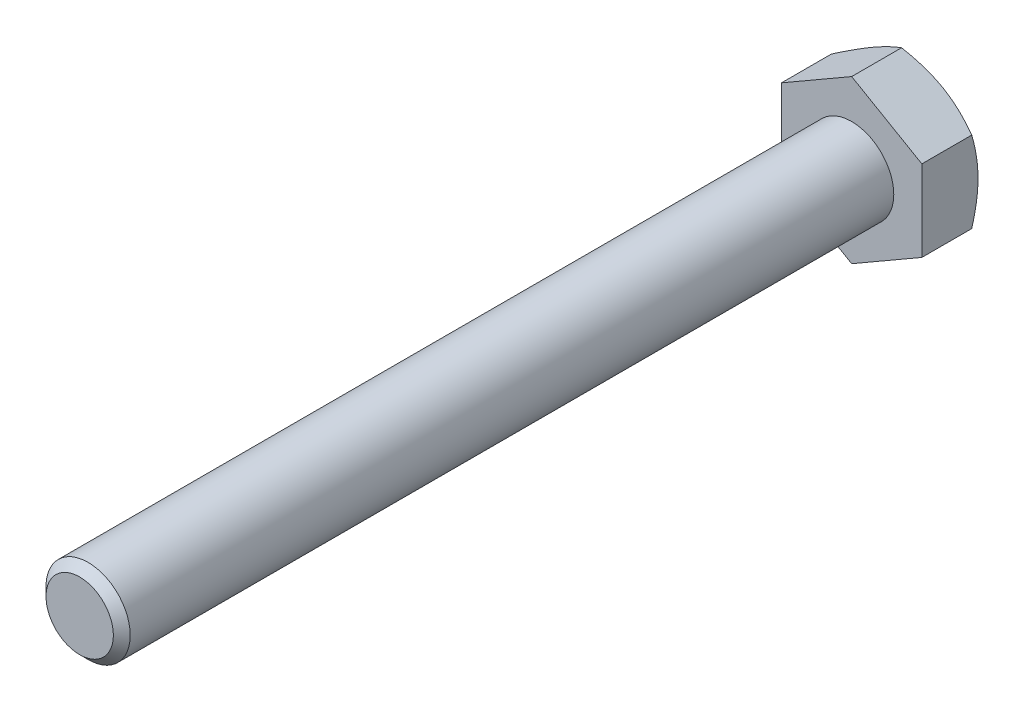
from build123d import *

# Parameters (mm, degrees)
ESQUISSE1_W        = 3
ESQUISSE1_H        = 55
CHANFREIN1_SIZE    = 0.6
BOSS_EXTRU_1_DEPTH = 4


with BuildPart() as part:
    # Esquisse1 → Base-R_volution (revolve)
    with BuildSketch(Plane(origin=(0, 0, 0), x_dir=(1, 0, 0), z_dir=(0, 1, 0))):
        with Locations((1.5, -27.5)):
            Rectangle(ESQUISSE1_W, ESQUISSE1_H)
    revolve(axis=Axis((0, 0, 0), (0, 0, 1)))

    # Chanfrein1
    chanfrein1_edges = [part.edges().sort_by_distance(p)[0] for p in [
        (-3, 0, 55),
    ]]
    chamfer(chanfrein1_edges, length=CHANFREIN1_SIZE)

    # Esquisse6 → Boss.-Extru.1 (add)
    with BuildSketch(Plane.XY):
        Polygon((5, -2.886751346), (5, 2.886751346), (0, 5.773502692), (-5, 2.886751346), (-5, -2.886751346), (0, -5.773502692), align=None)
    extrude(amount=-BOSS_EXTRU_1_DEPTH)

    # Esquisse7 → Enl_vement de mati_re-R_volution1 (revolve, cut)
    with BuildSketch(Plane(origin=(0, 0, 0), x_dir=(1, 0, 0), z_dir=(0, 1, 0))):
        Polygon((-5, 4), (-11.92820323, 4), (-11.92820323, 0), align=None)
    revolve(axis=Axis((0, 0, -6.239446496), (0, 0, 1)), mode=Mode.SUBTRACT)


solid = part.part
